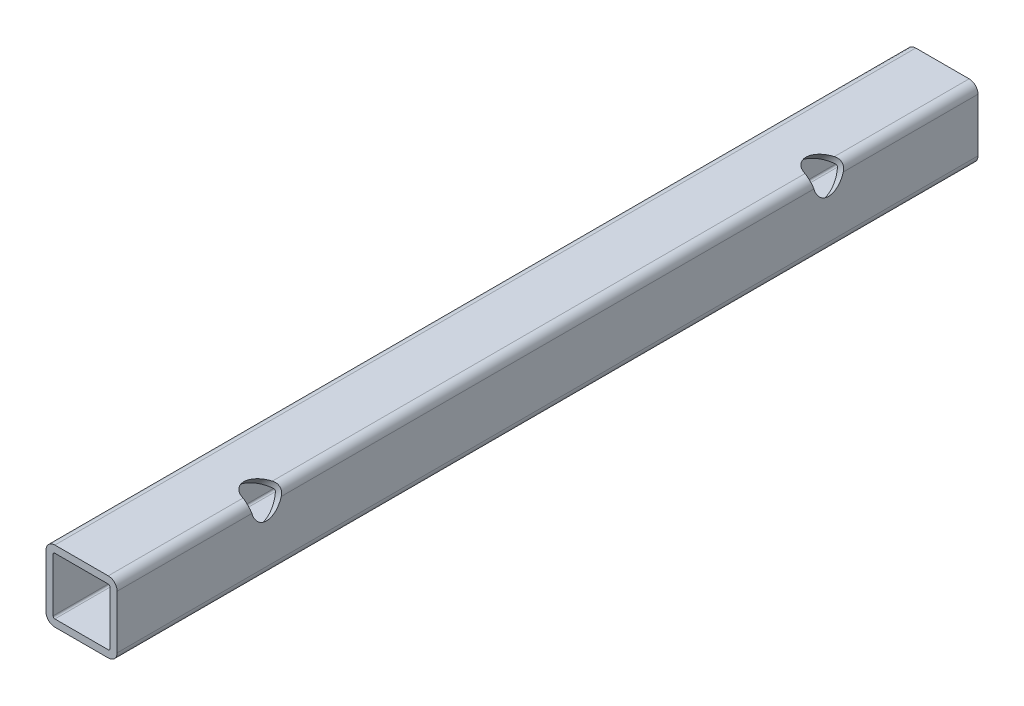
ISO-10303-21;
HEADER;
FILE_DESCRIPTION(('STEP AP214'),'2;1');
FILE_NAME('part.step','',(''),(''),'','','');
FILE_SCHEMA(('AUTOMOTIVE_DESIGN { 1 0 10303 214 1 1 1 1 }'));
ENDSEC;
DATA;
#1=APPLICATION_CONTEXT('core data for automotive mechanical design processes');
#2=APPLICATION_PROTOCOL_DEFINITION('international standard','automotive_design',2000,#1);
#3=PRODUCT_CONTEXT('',#1,'mechanical');
#4=PRODUCT('Part','Part','',(#3));
#5=PRODUCT_RELATED_PRODUCT_CATEGORY('part','',(#4));
#6=PRODUCT_DEFINITION_FORMATION('','',#4);
#7=PRODUCT_DEFINITION_CONTEXT('part definition',#1,'design');
#8=PRODUCT_DEFINITION('design','',#6,#7);
#9=PRODUCT_DEFINITION_SHAPE('','',#8);
#10=(LENGTH_UNIT() NAMED_UNIT(*) SI_UNIT(.MILLI.,.METRE.));
#11=(NAMED_UNIT(*) PLANE_ANGLE_UNIT() SI_UNIT($,.RADIAN.));
#12=(NAMED_UNIT(*) SI_UNIT($,.STERADIAN.) SOLID_ANGLE_UNIT());
#13=UNCERTAINTY_MEASURE_WITH_UNIT(LENGTH_MEASURE(1.E-05),#10,'distance_accuracy_value','');
#14=(GEOMETRIC_REPRESENTATION_CONTEXT(3) GLOBAL_UNCERTAINTY_ASSIGNED_CONTEXT((#13)) GLOBAL_UNIT_ASSIGNED_CONTEXT((#10,
#11,#12)) REPRESENTATION_CONTEXT('',''));
#15=CARTESIAN_POINT('',(0.,0.,0.));
#16=DIRECTION('',(0.,0.,1.));
#17=DIRECTION('',(1.,0.,0.));
#18=AXIS2_PLACEMENT_3D('',#15,#16,#17);
#19=CARTESIAN_POINT('',(7.5,7.5,121.));
#20=DIRECTION('',(0.,0.,-1.));
#21=DIRECTION('',(-1.,0.,0.));
#22=AXIS2_PLACEMENT_3D('',#19,#20,#21);
#23=CYLINDRICAL_SURFACE('',#22,2.5);
#24=DIRECTION('',(0.,0.,-1.));
#25=VECTOR('',#24,1.);
#26=CARTESIAN_POINT('',(10.,7.5,121.));
#27=LINE('',#26,#25);
#28=CARTESIAN_POINT('',(10.,7.5,74.8617636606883));
#29=VERTEX_POINT('',#28);
#30=CARTESIAN_POINT('',(10.,7.5,-74.8617636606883));
#31=VERTEX_POINT('',#30);
#32=EDGE_CURVE('E207',#29,#31,#27,.T.);
#33=ORIENTED_EDGE('',*,*,#32,.T.);
#34=CARTESIAN_POINT('',(7.5,10.,-74.8617636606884));
#35=CARTESIAN_POINT('',(7.56801742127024,9.99999288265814,-74.8412157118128));
#36=CARTESIAN_POINT('',(7.63605257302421,9.99722261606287,-74.8208214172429));
#37=CARTESIAN_POINT('',(7.77192206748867,9.98610525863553,-74.7807816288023));
#38=CARTESIAN_POINT('',(7.83975629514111,9.977755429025,-74.7611365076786));
#39=CARTESIAN_POINT('',(8.04304815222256,9.94417462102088,-74.7038644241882));
#40=CARTESIAN_POINT('',(8.17774096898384,9.91041140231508,-74.6680741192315));
#41=CARTESIAN_POINT('',(8.44188457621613,9.82000225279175,-74.6048703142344));
#42=CARTESIAN_POINT('',(8.57131520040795,9.76327602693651,-74.5774868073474));
#43=CARTESIAN_POINT('',(8.81994058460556,9.62783956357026,-74.5343029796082));
#44=CARTESIAN_POINT('',(8.93916097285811,9.54918661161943,-74.5184728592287));
#45=CARTESIAN_POINT('',(9.15322944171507,9.37984306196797,-74.5009833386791));
#46=CARTESIAN_POINT('',(9.24929710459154,9.29080637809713,-74.4982058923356));
#47=CARTESIAN_POINT('',(9.42618592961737,9.09900548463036,-74.5040612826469));
#48=CARTESIAN_POINT('',(9.50700658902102,8.99624082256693,-74.512694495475));
#49=CARTESIAN_POINT('',(9.64720068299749,8.78631364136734,-74.5397176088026));
#50=CARTESIAN_POINT('',(9.70750048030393,8.67969302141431,-74.557552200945));
#51=CARTESIAN_POINT('',(9.81150540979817,8.46007000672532,-74.6010903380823));
#52=CARTESIAN_POINT('',(9.85519170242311,8.34706053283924,-74.6268027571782));
#53=CARTESIAN_POINT('',(9.92706193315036,8.11241742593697,-74.6852974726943));
#54=CARTESIAN_POINT('',(9.95450938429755,7.99062132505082,-74.7183334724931));
#55=CARTESIAN_POINT('',(9.98185390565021,7.80696951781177,-74.7706121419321));
#56=CARTESIAN_POINT('',(9.98866438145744,7.74565786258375,-74.7884721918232));
#57=CARTESIAN_POINT('',(9.99773419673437,7.62289230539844,-74.824768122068));
#58=CARTESIAN_POINT('',(9.99999521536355,7.56143846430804,-74.8432037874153));
#59=CARTESIAN_POINT('',(10.,7.49999999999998,-74.8617636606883));
#60=B_SPLINE_CURVE_WITH_KNOTS('',3,(#34,#35,#36,#37,#38,#39,#40,#41,#42,#43,#44,#45,#46,#47,#48,
#49,#50,#51,#52,#53,#54,#55,#56,#57,#58,#59),.UNSPECIFIED.,.F.,.F.,(4,2,2,2,2,2,2,2,2,2,2,2,4),
(0.,0.213047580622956,0.426199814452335,0.854225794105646,1.28376156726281,1.71218548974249,
2.10314834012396,2.49412407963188,2.86386745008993,3.23402886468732,3.61989764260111,
3.81242599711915,4.00488327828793),.UNSPECIFIED.);
#61=CARTESIAN_POINT('',(7.5,10.,-74.8617636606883));
#62=VERTEX_POINT('',#61);
#63=EDGE_CURVE('E193',#62,#31,#60,.T.);
#64=ORIENTED_EDGE('',*,*,#63,.F.);
#65=DIRECTION('',(0.,0.,-1.));
#66=VECTOR('',#65,1.);
#67=CARTESIAN_POINT('',(7.5,10.,121.));
#68=LINE('',#67,#66);
#69=CARTESIAN_POINT('',(7.5,10.,74.8617636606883));
#70=VERTEX_POINT('',#69);
#71=EDGE_CURVE('E205',#70,#62,#68,.T.);
#72=ORIENTED_EDGE('',*,*,#71,.F.);
#73=CARTESIAN_POINT('',(10.,7.5,74.8617636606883));
#74=CARTESIAN_POINT('',(9.99999288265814,7.56801742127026,74.8412157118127));
#75=CARTESIAN_POINT('',(9.99722261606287,7.63605257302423,74.8208214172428));
#76=CARTESIAN_POINT('',(9.98610525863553,7.7719220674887,74.7807816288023));
#77=CARTESIAN_POINT('',(9.977755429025,7.83975629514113,74.7611365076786));
#78=CARTESIAN_POINT('',(9.94417462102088,8.04304815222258,74.7038644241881));
#79=CARTESIAN_POINT('',(9.91041140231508,8.17774096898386,74.6680741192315));
#80=CARTESIAN_POINT('',(9.82000225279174,8.44188457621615,74.6048703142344));
#81=CARTESIAN_POINT('',(9.7632760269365,8.57131520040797,74.5774868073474));
#82=CARTESIAN_POINT('',(9.62783956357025,8.81994058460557,74.5343029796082));
#83=CARTESIAN_POINT('',(9.54918661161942,8.93916097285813,74.5184728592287));
#84=CARTESIAN_POINT('',(9.37984306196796,9.15322944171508,74.5009833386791));
#85=CARTESIAN_POINT('',(9.29080637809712,9.24929710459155,74.4982058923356));
#86=CARTESIAN_POINT('',(9.09900548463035,9.42618592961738,74.5040612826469));
#87=CARTESIAN_POINT('',(8.99624082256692,9.50700658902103,74.512694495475));
#88=CARTESIAN_POINT('',(8.78631364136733,9.64720068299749,74.5397176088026));
#89=CARTESIAN_POINT('',(8.67969302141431,9.70750048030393,74.557552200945));
#90=CARTESIAN_POINT('',(8.46007000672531,9.81150540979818,74.6010903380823));
#91=CARTESIAN_POINT('',(8.34706053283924,9.85519170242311,74.6268027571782));
#92=CARTESIAN_POINT('',(8.11241742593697,9.92706193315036,74.6852974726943));
#93=CARTESIAN_POINT('',(7.99062132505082,9.95450938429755,74.7183334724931));
#94=CARTESIAN_POINT('',(7.80696951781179,9.98185390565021,74.7706121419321));
#95=CARTESIAN_POINT('',(7.74565786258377,9.98866438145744,74.7884721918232));
#96=CARTESIAN_POINT('',(7.62289230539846,9.99773419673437,74.824768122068));
#97=CARTESIAN_POINT('',(7.56143846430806,9.99999521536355,74.8432037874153));
#98=CARTESIAN_POINT('',(7.5,10.,74.8617636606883));
#99=B_SPLINE_CURVE_WITH_KNOTS('',3,(#73,#74,#75,#76,#77,#78,#79,#80,#81,#82,#83,#84,#85,#86,#87,
#88,#89,#90,#91,#92,#93,#94,#95,#96,#97,#98),.UNSPECIFIED.,.F.,.F.,(4,2,2,2,2,2,2,2,2,2,2,2,4),
(0.,0.21304758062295,0.426199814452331,0.854225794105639,1.28376156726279,1.71218548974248,
2.10314834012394,2.49412407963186,2.8638674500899,3.2340288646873,3.61989764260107,
3.8124259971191,4.00488327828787),.UNSPECIFIED.);
#100=EDGE_CURVE('E407',#29,#70,#99,.T.);
#101=ORIENTED_EDGE('',*,*,#100,.F.);
#102=EDGE_LOOP('',(#33,#64,#72,#101));
#103=FACE_BOUND('',#102,.T.);
#104=ADVANCED_FACE('F32',(#103),#23,.T.);
#105=CARTESIAN_POINT('',(7.5,7.5,121.));
#106=DIRECTION('',(0.,0.,-1.));
#107=DIRECTION('',(-1.,0.,0.));
#108=AXIS2_PLACEMENT_3D('',#105,#106,#107);
#109=CYLINDRICAL_SURFACE('',#108,0.5);
#110=CARTESIAN_POINT('',(7.5,8.,-74.5139103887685));
#111=CARTESIAN_POINT('',(7.52809632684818,8.00002306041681,-74.5123413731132));
#112=CARTESIAN_POINT('',(7.55618767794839,7.99763311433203,-74.5107793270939));
#113=CARTESIAN_POINT('',(7.61157101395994,7.98819497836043,-74.5078298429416));
#114=CARTESIAN_POINT('',(7.63886342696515,7.98114933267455,-74.5064423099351));
#115=CARTESIAN_POINT('',(7.69190775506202,7.96256165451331,-74.503999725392));
#116=CARTESIAN_POINT('',(7.71765873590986,7.95101692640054,-74.5029448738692));
#117=CARTESIAN_POINT('',(7.76686103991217,7.92376338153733,-74.5012867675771));
#118=CARTESIAN_POINT('',(7.7903129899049,7.90805570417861,-74.5006833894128));
#119=CARTESIAN_POINT('',(7.83416242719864,7.87298876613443,-74.499997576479));
#120=CARTESIAN_POINT('',(7.85457161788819,7.85364417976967,-74.499913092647));
#121=CARTESIAN_POINT('',(7.89186655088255,7.81181059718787,-74.5002690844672));
#122=CARTESIAN_POINT('',(7.90875163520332,7.78932101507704,-74.5007096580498));
#123=CARTESIAN_POINT('',(7.93847910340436,7.74190405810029,-74.5020646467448));
#124=CARTESIAN_POINT('',(7.95133107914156,7.71698265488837,-74.5029779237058));
#125=CARTESIAN_POINT('',(7.97268817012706,7.66536329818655,-74.5051760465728));
#126=CARTESIAN_POINT('',(7.98119545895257,7.63866624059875,-74.5064607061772));
#127=CARTESIAN_POINT('',(7.99159862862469,7.59318413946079,-74.5087988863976));
#128=CARTESIAN_POINT('',(7.99474740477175,7.57467243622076,-74.5097902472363));
#129=CARTESIAN_POINT('',(7.99894779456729,7.53744290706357,-74.5118241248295));
#130=CARTESIAN_POINT('',(8.00000246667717,7.51872542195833,-74.5128665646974));
#131=CARTESIAN_POINT('',(8.,7.49999999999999,-74.5139103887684));
#132=B_SPLINE_CURVE_WITH_KNOTS('',3,(#110,#111,#112,#113,#114,#115,#116,#117,#118,#119,#120,
#121,#122,#123,#124,#125,#126,#127,#128,#129,#130,#131),.UNSPECIFIED.,.F.,.F.,(4,2,2,2,2,2,2,2,
2,2,4),(0.,0.084311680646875,0.168577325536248,0.252893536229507,0.337186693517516,
0.421146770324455,0.505122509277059,0.588896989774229,0.672629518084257,0.728930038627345,
0.785148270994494),.UNSPECIFIED.);
#133=CARTESIAN_POINT('',(7.5,8.,-74.5139103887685));
#134=VERTEX_POINT('',#133);
#135=CARTESIAN_POINT('',(8.,7.5,-74.5139103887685));
#136=VERTEX_POINT('',#135);
#137=EDGE_CURVE('E55',#134,#136,#132,.T.);
#138=ORIENTED_EDGE('',*,*,#137,.T.);
#139=DIRECTION('',(0.,0.,-1.));
#140=VECTOR('',#139,1.);
#141=CARTESIAN_POINT('',(8.,7.5,121.));
#142=LINE('',#141,#140);
#143=CARTESIAN_POINT('',(8.,7.5,74.5139103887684));
#144=VERTEX_POINT('',#143);
#145=EDGE_CURVE('E320',#144,#136,#142,.T.);
#146=ORIENTED_EDGE('',*,*,#145,.F.);
#147=CARTESIAN_POINT('',(8.,7.5,74.5139103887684));
#148=CARTESIAN_POINT('',(8.00002306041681,7.52809632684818,74.5123413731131));
#149=CARTESIAN_POINT('',(7.99763311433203,7.55618767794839,74.5107793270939));
#150=CARTESIAN_POINT('',(7.98819497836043,7.61157101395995,74.5078298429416));
#151=CARTESIAN_POINT('',(7.98114933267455,7.63886342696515,74.5064423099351));
#152=CARTESIAN_POINT('',(7.9625616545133,7.69190775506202,74.503999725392));
#153=CARTESIAN_POINT('',(7.95101692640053,7.71765873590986,74.5029448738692));
#154=CARTESIAN_POINT('',(7.92376338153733,7.76686103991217,74.5012867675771));
#155=CARTESIAN_POINT('',(7.9080557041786,7.79031298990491,74.5006833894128));
#156=CARTESIAN_POINT('',(7.87298876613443,7.83416242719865,74.499997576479));
#157=CARTESIAN_POINT('',(7.85364417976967,7.8545716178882,74.499913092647));
#158=CARTESIAN_POINT('',(7.81181059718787,7.89186655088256,74.5002690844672));
#159=CARTESIAN_POINT('',(7.78932101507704,7.90875163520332,74.5007096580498));
#160=CARTESIAN_POINT('',(7.74190405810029,7.93847910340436,74.5020646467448));
#161=CARTESIAN_POINT('',(7.71698265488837,7.95133107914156,74.5029779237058));
#162=CARTESIAN_POINT('',(7.66536329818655,7.97268817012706,74.5051760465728));
#163=CARTESIAN_POINT('',(7.63866624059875,7.98119545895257,74.5064607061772));
#164=CARTESIAN_POINT('',(7.59318413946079,7.99159862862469,74.5087988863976));
#165=CARTESIAN_POINT('',(7.57467243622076,7.99474740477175,74.5097902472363));
#166=CARTESIAN_POINT('',(7.53744290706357,7.99894779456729,74.5118241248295));
#167=CARTESIAN_POINT('',(7.51872542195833,8.00000246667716,74.5128665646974));
#168=CARTESIAN_POINT('',(7.5,8.,74.5139103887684));
#169=B_SPLINE_CURVE_WITH_KNOTS('',3,(#147,#148,#149,#150,#151,#152,#153,#154,#155,#156,#157,
#158,#159,#160,#161,#162,#163,#164,#165,#166,#167,#168),.UNSPECIFIED.,.F.,.F.,(4,2,2,2,2,2,2,2,
2,2,4),(0.,0.0843116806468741,0.168577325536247,0.252893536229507,0.337186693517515,
0.421146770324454,0.505122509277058,0.588896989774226,0.672629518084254,0.728930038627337,
0.785148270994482),.UNSPECIFIED.);
#170=CARTESIAN_POINT('',(7.5,8.,74.5139103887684));
#171=VERTEX_POINT('',#170);
#172=EDGE_CURVE('E376',#144,#171,#169,.T.);
#173=ORIENTED_EDGE('',*,*,#172,.T.);
#174=DIRECTION('',(0.,0.,-1.));
#175=VECTOR('',#174,1.);
#176=CARTESIAN_POINT('',(7.5,8.,121.));
#177=LINE('',#176,#175);
#178=EDGE_CURVE('E325',#171,#134,#177,.T.);
#179=ORIENTED_EDGE('',*,*,#178,.T.);
#180=EDGE_LOOP('',(#138,#146,#173,#179));
#181=FACE_BOUND('',#180,.T.);
#182=ADVANCED_FACE('F447',(#181),#109,.F.);
#183=CARTESIAN_POINT('',(10.,7.5,121.));
#184=VERTEX_POINT('',#183);
#185=CARTESIAN_POINT('',(10.,7.5,83.1382363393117));
#186=VERTEX_POINT('',#185);
#187=EDGE_CURVE('E221',#184,#186,#27,.T.);
#188=ORIENTED_EDGE('',*,*,#187,.T.);
#189=CARTESIAN_POINT('',(7.5,10.,83.1382363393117));
#190=CARTESIAN_POINT('',(7.56801742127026,9.99999288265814,83.1587842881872));
#191=CARTESIAN_POINT('',(7.63605257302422,9.99722261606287,83.1791785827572));
#192=CARTESIAN_POINT('',(7.77192206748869,9.98610525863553,83.2192183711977));
#193=CARTESIAN_POINT('',(7.83975629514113,9.977755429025,83.2388634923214));
#194=CARTESIAN_POINT('',(8.04304815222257,9.94417462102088,83.2961355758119));
#195=CARTESIAN_POINT('',(8.17774096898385,9.91041140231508,83.3319258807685));
#196=CARTESIAN_POINT('',(8.44188457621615,9.82000225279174,83.3951296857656));
#197=CARTESIAN_POINT('',(8.57131520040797,9.7632760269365,83.4225131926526));
#198=CARTESIAN_POINT('',(8.81994058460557,9.62783956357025,83.4656970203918));
#199=CARTESIAN_POINT('',(8.93916097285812,9.54918661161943,83.4815271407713));
#200=CARTESIAN_POINT('',(9.15322944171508,9.37984306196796,83.4990166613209));
#201=CARTESIAN_POINT('',(9.24929710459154,9.29080637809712,83.5017941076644));
#202=CARTESIAN_POINT('',(9.42618592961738,9.09900548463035,83.4959387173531));
#203=CARTESIAN_POINT('',(9.50700658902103,8.99624082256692,83.487305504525));
#204=CARTESIAN_POINT('',(9.64720068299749,8.78631364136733,83.4602823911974));
#205=CARTESIAN_POINT('',(9.70750048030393,8.67969302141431,83.442447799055));
#206=CARTESIAN_POINT('',(9.81150540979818,8.46007000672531,83.3989096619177));
#207=CARTESIAN_POINT('',(9.85519170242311,8.34706053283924,83.3731972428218));
#208=CARTESIAN_POINT('',(9.92706193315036,8.11241742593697,83.3147025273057));
#209=CARTESIAN_POINT('',(9.95450938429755,7.99062132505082,83.2816665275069));
#210=CARTESIAN_POINT('',(9.98185390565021,7.80696951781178,83.2293878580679));
#211=CARTESIAN_POINT('',(9.98866438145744,7.74565786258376,83.2115278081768));
#212=CARTESIAN_POINT('',(9.99773419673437,7.62289230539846,83.175231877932));
#213=CARTESIAN_POINT('',(9.99999521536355,7.56143846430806,83.1567962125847));
#214=CARTESIAN_POINT('',(10.,7.49999999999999,83.1382363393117));
#215=B_SPLINE_CURVE_WITH_KNOTS('',3,(#189,#190,#191,#192,#193,#194,#195,#196,#197,#198,#199,
#200,#201,#202,#203,#204,#205,#206,#207,#208,#209,#210,#211,#212,#213,#214),.UNSPECIFIED.,.F.,
.F.,(4,2,2,2,2,2,2,2,2,2,2,2,4),(0.,0.213047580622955,0.426199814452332,0.854225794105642,
1.28376156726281,1.71218548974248,2.10314834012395,2.49412407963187,2.86386745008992,
3.23402886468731,3.61989764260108,3.81242599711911,4.00488327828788),.UNSPECIFIED.);
#216=CARTESIAN_POINT('',(7.5,10.,83.1382363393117));
#217=VERTEX_POINT('',#216);
#218=EDGE_CURVE('E401',#217,#186,#215,.T.);
#219=ORIENTED_EDGE('',*,*,#218,.F.);
#220=CARTESIAN_POINT('',(7.5,10.,121.));
#221=VERTEX_POINT('',#220);
#222=EDGE_CURVE('E213',#221,#217,#68,.T.);
#223=ORIENTED_EDGE('',*,*,#222,.F.);
#224=CARTESIAN_POINT('',(7.5,7.5,121.));
#225=DIRECTION('',(0.,0.,1.));
#226=DIRECTION('',(-1.,0.,0.));
#227=AXIS2_PLACEMENT_3D('',#224,#225,#226);
#228=CIRCLE('',#227,2.5);
#229=EDGE_CURVE('E297',#184,#221,#228,.T.);
#230=ORIENTED_EDGE('',*,*,#229,.F.);
#231=EDGE_LOOP('',(#188,#219,#223,#230));
#232=FACE_BOUND('',#231,.T.);
#233=ADVANCED_FACE('F460',(#232),#23,.T.);
#234=CARTESIAN_POINT('',(7.5,8.,83.4860896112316));
#235=CARTESIAN_POINT('',(7.52809632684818,8.00002306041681,83.4876586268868));
#236=CARTESIAN_POINT('',(7.55618767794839,7.99763311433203,83.4892206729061));
#237=CARTESIAN_POINT('',(7.61157101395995,7.98819497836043,83.4921701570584));
#238=CARTESIAN_POINT('',(7.63886342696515,7.98114933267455,83.4935576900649));
#239=CARTESIAN_POINT('',(7.69190775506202,7.9625616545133,83.496000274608));
#240=CARTESIAN_POINT('',(7.71765873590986,7.95101692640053,83.4970551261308));
#241=CARTESIAN_POINT('',(7.76686103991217,7.92376338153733,83.4987132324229));
#242=CARTESIAN_POINT('',(7.79031298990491,7.9080557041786,83.4993166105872));
#243=CARTESIAN_POINT('',(7.83416242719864,7.87298876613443,83.500002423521));
#244=CARTESIAN_POINT('',(7.8545716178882,7.85364417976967,83.500086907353));
#245=CARTESIAN_POINT('',(7.89186655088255,7.81181059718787,83.4997309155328));
#246=CARTESIAN_POINT('',(7.90875163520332,7.78932101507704,83.4992903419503));
#247=CARTESIAN_POINT('',(7.93847910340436,7.74190405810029,83.4979353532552));
#248=CARTESIAN_POINT('',(7.95133107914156,7.71698265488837,83.4970220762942));
#249=CARTESIAN_POINT('',(7.97268817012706,7.66536329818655,83.4948239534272));
#250=CARTESIAN_POINT('',(7.98119545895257,7.63866624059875,83.4935392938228));
#251=CARTESIAN_POINT('',(7.99159862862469,7.59318413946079,83.4912011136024));
#252=CARTESIAN_POINT('',(7.99474740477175,7.57467243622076,83.4902097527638));
#253=CARTESIAN_POINT('',(7.99894779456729,7.53744290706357,83.4881758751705));
#254=CARTESIAN_POINT('',(8.00000246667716,7.51872542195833,83.4871334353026));
#255=CARTESIAN_POINT('',(8.,7.5,83.4860896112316));
#256=B_SPLINE_CURVE_WITH_KNOTS('',3,(#234,#235,#236,#237,#238,#239,#240,#241,#242,#243,#244,
#245,#246,#247,#248,#249,#250,#251,#252,#253,#254,#255),.UNSPECIFIED.,.F.,.F.,(4,2,2,2,2,2,2,2,
2,2,4),(0.,0.0843116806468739,0.168577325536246,0.252893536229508,0.337186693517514,
0.421146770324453,0.505122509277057,0.588896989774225,0.672629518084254,0.728930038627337,
0.785148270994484),.UNSPECIFIED.);
#257=CARTESIAN_POINT('',(7.5,8.,83.4860896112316));
#258=VERTEX_POINT('',#257);
#259=CARTESIAN_POINT('',(8.,7.5,83.4860896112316));
#260=VERTEX_POINT('',#259);
#261=EDGE_CURVE('E384',#258,#260,#256,.T.);
#262=ORIENTED_EDGE('',*,*,#261,.T.);
#263=CARTESIAN_POINT('',(8.,7.5,121.));
#264=VERTEX_POINT('',#263);
#265=EDGE_CURVE('E317',#264,#260,#142,.T.);
#266=ORIENTED_EDGE('',*,*,#265,.F.);
#267=CARTESIAN_POINT('',(7.5,7.5,121.));
#268=DIRECTION('',(0.,0.,1.));
#269=DIRECTION('',(-1.,0.,0.));
#270=AXIS2_PLACEMENT_3D('',#267,#268,#269);
#271=CIRCLE('',#270,0.5);
#272=CARTESIAN_POINT('',(7.5,8.,121.));
#273=VERTEX_POINT('',#272);
#274=EDGE_CURVE('E357',#264,#273,#271,.T.);
#275=ORIENTED_EDGE('',*,*,#274,.T.);
#276=EDGE_CURVE('E322',#273,#258,#177,.T.);
#277=ORIENTED_EDGE('',*,*,#276,.T.);
#278=EDGE_LOOP('',(#262,#266,#275,#277));
#279=FACE_BOUND('',#278,.T.);
#280=ADVANCED_FACE('F418',(#279),#109,.F.);
#281=CARTESIAN_POINT('',(-7.5,-7.5,121.));
#282=DIRECTION('',(0.,0.,1.));
#283=DIRECTION('',(1.,0.,0.));
#284=AXIS2_PLACEMENT_3D('',#281,#282,#283);
#285=PLANE('',#284);
#286=CARTESIAN_POINT('',(-7.5,-7.5,121.));
#287=DIRECTION('',(0.,0.,1.));
#288=DIRECTION('',(1.,0.,0.));
#289=AXIS2_PLACEMENT_3D('',#286,#287,#288);
#290=CIRCLE('',#289,2.5);
#291=CARTESIAN_POINT('',(-10.,-7.5,121.));
#292=VERTEX_POINT('',#291);
#293=CARTESIAN_POINT('',(-7.5,-10.,121.));
#294=VERTEX_POINT('',#293);
#295=EDGE_CURVE('E260',#292,#294,#290,.T.);
#296=ORIENTED_EDGE('',*,*,#295,.T.);
#297=DIRECTION('',(1.,0.,0.));
#298=VECTOR('',#297,1.);
#299=CARTESIAN_POINT('',(-7.5,-10.,121.));
#300=LINE('',#299,#298);
#301=CARTESIAN_POINT('',(7.5,-10.,121.));
#302=VERTEX_POINT('',#301);
#303=EDGE_CURVE('E287',#294,#302,#300,.T.);
#304=ORIENTED_EDGE('',*,*,#303,.T.);
#305=CARTESIAN_POINT('',(7.5,-7.5,121.));
#306=DIRECTION('',(0.,0.,1.));
#307=DIRECTION('',(1.,0.,0.));
#308=AXIS2_PLACEMENT_3D('',#305,#306,#307);
#309=CIRCLE('',#308,2.5);
#310=CARTESIAN_POINT('',(10.,-7.5,121.));
#311=VERTEX_POINT('',#310);
#312=EDGE_CURVE('E234',#302,#311,#309,.T.);
#313=ORIENTED_EDGE('',*,*,#312,.T.);
#314=DIRECTION('',(0.,1.,0.));
#315=VECTOR('',#314,1.);
#316=CARTESIAN_POINT('',(10.,7.5,121.));
#317=LINE('',#316,#315);
#318=EDGE_CURVE('E295',#311,#184,#317,.T.);
#319=ORIENTED_EDGE('',*,*,#318,.T.);
#320=ORIENTED_EDGE('',*,*,#229,.T.);
#321=DIRECTION('',(-1.,0.,0.));
#322=VECTOR('',#321,1.);
#323=CARTESIAN_POINT('',(-7.5,10.,121.));
#324=LINE('',#323,#322);
#325=CARTESIAN_POINT('',(-7.5,10.,121.));
#326=VERTEX_POINT('',#325);
#327=EDGE_CURVE('E299',#221,#326,#324,.T.);
#328=ORIENTED_EDGE('',*,*,#327,.T.);
#329=CARTESIAN_POINT('',(-7.5,7.5,121.));
#330=DIRECTION('',(0.,0.,1.));
#331=DIRECTION('',(1.,0.,0.));
#332=AXIS2_PLACEMENT_3D('',#329,#330,#331);
#333=CIRCLE('',#332,2.5);
#334=CARTESIAN_POINT('',(-10.,7.5,121.));
#335=VERTEX_POINT('',#334);
#336=EDGE_CURVE('E276',#326,#335,#333,.T.);
#337=ORIENTED_EDGE('',*,*,#336,.T.);
#338=DIRECTION('',(0.,-1.,0.));
#339=VECTOR('',#338,1.);
#340=CARTESIAN_POINT('',(-10.,7.5,121.));
#341=LINE('',#340,#339);
#342=EDGE_CURVE('E264',#335,#292,#341,.T.);
#343=ORIENTED_EDGE('',*,*,#342,.T.);
#344=EDGE_LOOP('',(#296,#304,#313,#319,#320,#328,#337,#343));
#345=FACE_BOUND('',#344,.T.);
#346=DIRECTION('',(0.,-1.,0.));
#347=VECTOR('',#346,1.);
#348=CARTESIAN_POINT('',(-8.,7.5,121.));
#349=LINE('',#348,#347);
#350=CARTESIAN_POINT('',(-8.,7.5,121.));
#351=VERTEX_POINT('',#350);
#352=CARTESIAN_POINT('',(-8.,-7.5,121.));
#353=VERTEX_POINT('',#352);
#354=EDGE_CURVE('E368',#351,#353,#349,.T.);
#355=ORIENTED_EDGE('',*,*,#354,.F.);
#356=CARTESIAN_POINT('',(-7.5,7.5,121.));
#357=DIRECTION('',(0.,0.,1.));
#358=DIRECTION('',(1.,0.,0.));
#359=AXIS2_PLACEMENT_3D('',#356,#357,#358);
#360=CIRCLE('',#359,0.5);
#361=CARTESIAN_POINT('',(-7.5,8.,121.));
#362=VERTEX_POINT('',#361);
#363=EDGE_CURVE('E334',#362,#351,#360,.T.);
#364=ORIENTED_EDGE('',*,*,#363,.F.);
#365=DIRECTION('',(-1.,0.,0.));
#366=VECTOR('',#365,1.);
#367=CARTESIAN_POINT('',(-7.5,8.,121.));
#368=LINE('',#367,#366);
#369=EDGE_CURVE('E330',#273,#362,#368,.T.);
#370=ORIENTED_EDGE('',*,*,#369,.F.);
#371=ORIENTED_EDGE('',*,*,#274,.F.);
#372=DIRECTION('',(0.,1.,0.));
#373=VECTOR('',#372,1.);
#374=CARTESIAN_POINT('',(8.,7.5,121.));
#375=LINE('',#374,#373);
#376=CARTESIAN_POINT('',(8.,-7.5,121.));
#377=VERTEX_POINT('',#376);
#378=EDGE_CURVE('E360',#377,#264,#375,.T.);
#379=ORIENTED_EDGE('',*,*,#378,.F.);
#380=CARTESIAN_POINT('',(7.5,-7.5,121.));
#381=DIRECTION('',(0.,0.,1.));
#382=DIRECTION('',(1.,0.,0.));
#383=AXIS2_PLACEMENT_3D('',#380,#381,#382);
#384=CIRCLE('',#383,0.500000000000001);
#385=CARTESIAN_POINT('',(7.5,-8.,121.));
#386=VERTEX_POINT('',#385);
#387=EDGE_CURVE('E362',#386,#377,#384,.T.);
#388=ORIENTED_EDGE('',*,*,#387,.F.);
#389=DIRECTION('',(1.,0.,0.));
#390=VECTOR('',#389,1.);
#391=CARTESIAN_POINT('',(-7.5,-8.,121.));
#392=LINE('',#391,#390);
#393=CARTESIAN_POINT('',(-7.5,-8.,121.));
#394=VERTEX_POINT('',#393);
#395=EDGE_CURVE('E364',#394,#386,#392,.T.);
#396=ORIENTED_EDGE('',*,*,#395,.F.);
#397=CARTESIAN_POINT('',(-7.5,-7.5,121.));
#398=DIRECTION('',(0.,0.,1.));
#399=DIRECTION('',(1.,0.,0.));
#400=AXIS2_PLACEMENT_3D('',#397,#398,#399);
#401=CIRCLE('',#400,0.5);
#402=EDGE_CURVE('E366',#353,#394,#401,.T.);
#403=ORIENTED_EDGE('',*,*,#402,.F.);
#404=EDGE_LOOP('',(#355,#364,#370,#371,#379,#388,#396,#403));
#405=FACE_BOUND('',#404,.T.);
#406=ADVANCED_FACE('F432',(#345,#405),#285,.T.);
#407=CARTESIAN_POINT('',(-7.5,-7.5,-121.));
#408=DIRECTION('',(0.,0.,1.));
#409=DIRECTION('',(1.,0.,0.));
#410=AXIS2_PLACEMENT_3D('',#407,#408,#409);
#411=PLANE('',#410);
#412=CARTESIAN_POINT('',(-7.5,-7.5,-121.));
#413=DIRECTION('',(0.,0.,1.));
#414=DIRECTION('',(1.,0.,0.));
#415=AXIS2_PLACEMENT_3D('',#412,#413,#414);
#416=CIRCLE('',#415,2.5);
#417=CARTESIAN_POINT('',(-10.,-7.5,-121.));
#418=VERTEX_POINT('',#417);
#419=CARTESIAN_POINT('',(-7.5,-10.,-121.));
#420=VERTEX_POINT('',#419);
#421=EDGE_CURVE('E248',#418,#420,#416,.T.);
#422=ORIENTED_EDGE('',*,*,#421,.F.);
#423=DIRECTION('',(0.,-1.,0.));
#424=VECTOR('',#423,1.);
#425=CARTESIAN_POINT('',(-10.,7.5,-121.));
#426=LINE('',#425,#424);
#427=CARTESIAN_POINT('',(-10.,7.5,-121.));
#428=VERTEX_POINT('',#427);
#429=EDGE_CURVE('E258',#428,#418,#426,.T.);
#430=ORIENTED_EDGE('',*,*,#429,.F.);
#431=CARTESIAN_POINT('',(-7.5,7.5,-121.));
#432=DIRECTION('',(0.,0.,1.));
#433=DIRECTION('',(1.,0.,0.));
#434=AXIS2_PLACEMENT_3D('',#431,#432,#433);
#435=CIRCLE('',#434,2.5);
#436=CARTESIAN_POINT('',(-7.5,10.,-121.));
#437=VERTEX_POINT('',#436);
#438=EDGE_CURVE('E256',#437,#428,#435,.T.);
#439=ORIENTED_EDGE('',*,*,#438,.F.);
#440=DIRECTION('',(-1.,0.,0.));
#441=VECTOR('',#440,1.);
#442=CARTESIAN_POINT('',(-7.5,10.,-121.));
#443=LINE('',#442,#441);
#444=CARTESIAN_POINT('',(7.5,10.,-121.));
#445=VERTEX_POINT('',#444);
#446=EDGE_CURVE('E254',#445,#437,#443,.T.);
#447=ORIENTED_EDGE('',*,*,#446,.F.);
#448=CARTESIAN_POINT('',(7.5,7.5,-121.));
#449=DIRECTION('',(0.,0.,1.));
#450=DIRECTION('',(-1.,0.,0.));
#451=AXIS2_PLACEMENT_3D('',#448,#449,#450);
#452=CIRCLE('',#451,2.5);
#453=CARTESIAN_POINT('',(10.,7.5,-121.));
#454=VERTEX_POINT('',#453);
#455=EDGE_CURVE('E246',#454,#445,#452,.T.);
#456=ORIENTED_EDGE('',*,*,#455,.F.);
#457=DIRECTION('',(0.,1.,0.));
#458=VECTOR('',#457,1.);
#459=CARTESIAN_POINT('',(10.,7.5,-121.));
#460=LINE('',#459,#458);
#461=CARTESIAN_POINT('',(10.,-7.5,-121.));
#462=VERTEX_POINT('',#461);
#463=EDGE_CURVE('E244',#462,#454,#460,.T.);
#464=ORIENTED_EDGE('',*,*,#463,.F.);
#465=CARTESIAN_POINT('',(7.5,-7.5,-121.));
#466=DIRECTION('',(0.,0.,1.));
#467=DIRECTION('',(1.,0.,0.));
#468=AXIS2_PLACEMENT_3D('',#465,#466,#467);
#469=CIRCLE('',#468,2.5);
#470=CARTESIAN_POINT('',(7.5,-10.,-121.));
#471=VERTEX_POINT('',#470);
#472=EDGE_CURVE('E233',#471,#462,#469,.T.);
#473=ORIENTED_EDGE('',*,*,#472,.F.);
#474=DIRECTION('',(1.,0.,0.));
#475=VECTOR('',#474,1.);
#476=CARTESIAN_POINT('',(-7.5,-10.,-121.));
#477=LINE('',#476,#475);
#478=EDGE_CURVE('E241',#420,#471,#477,.T.);
#479=ORIENTED_EDGE('',*,*,#478,.F.);
#480=EDGE_LOOP('',(#422,#430,#439,#447,#456,#464,#473,#479));
#481=FACE_BOUND('',#480,.T.);
#482=CARTESIAN_POINT('',(-7.5,7.5,-121.));
#483=DIRECTION('',(0.,0.,1.));
#484=DIRECTION('',(1.,0.,0.));
#485=AXIS2_PLACEMENT_3D('',#482,#483,#484);
#486=CIRCLE('',#485,0.5);
#487=CARTESIAN_POINT('',(-7.5,8.,-121.));
#488=VERTEX_POINT('',#487);
#489=CARTESIAN_POINT('',(-8.,7.5,-121.));
#490=VERTEX_POINT('',#489);
#491=EDGE_CURVE('E353',#488,#490,#486,.T.);
#492=ORIENTED_EDGE('',*,*,#491,.T.);
#493=DIRECTION('',(0.,-1.,0.));
#494=VECTOR('',#493,1.);
#495=CARTESIAN_POINT('',(-8.,7.5,-121.));
#496=LINE('',#495,#494);
#497=CARTESIAN_POINT('',(-8.,-7.5,-121.));
#498=VERTEX_POINT('',#497);
#499=EDGE_CURVE('E350',#490,#498,#496,.T.);
#500=ORIENTED_EDGE('',*,*,#499,.T.);
#501=CARTESIAN_POINT('',(-7.5,-7.5,-121.));
#502=DIRECTION('',(0.,0.,1.));
#503=DIRECTION('',(1.,0.,0.));
#504=AXIS2_PLACEMENT_3D('',#501,#502,#503);
#505=CIRCLE('',#504,0.5);
#506=CARTESIAN_POINT('',(-7.5,-8.,-121.));
#507=VERTEX_POINT('',#506);
#508=EDGE_CURVE('E347',#498,#507,#505,.T.);
#509=ORIENTED_EDGE('',*,*,#508,.T.);
#510=DIRECTION('',(1.,0.,0.));
#511=VECTOR('',#510,1.);
#512=CARTESIAN_POINT('',(-7.5,-8.,-121.));
#513=LINE('',#512,#511);
#514=CARTESIAN_POINT('',(7.5,-8.,-121.));
#515=VERTEX_POINT('',#514);
#516=EDGE_CURVE('E344',#507,#515,#513,.T.);
#517=ORIENTED_EDGE('',*,*,#516,.T.);
#518=CARTESIAN_POINT('',(7.5,-7.5,-121.));
#519=DIRECTION('',(0.,0.,1.));
#520=DIRECTION('',(1.,0.,0.));
#521=AXIS2_PLACEMENT_3D('',#518,#519,#520);
#522=CIRCLE('',#521,0.500000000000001);
#523=CARTESIAN_POINT('',(8.,-7.5,-121.));
#524=VERTEX_POINT('',#523);
#525=EDGE_CURVE('E341',#515,#524,#522,.T.);
#526=ORIENTED_EDGE('',*,*,#525,.T.);
#527=DIRECTION('',(0.,1.,0.));
#528=VECTOR('',#527,1.);
#529=CARTESIAN_POINT('',(8.,7.5,-121.));
#530=LINE('',#529,#528);
#531=CARTESIAN_POINT('',(8.,7.5,-121.));
#532=VERTEX_POINT('',#531);
#533=EDGE_CURVE('E338',#524,#532,#530,.T.);
#534=ORIENTED_EDGE('',*,*,#533,.T.);
#535=CARTESIAN_POINT('',(7.5,7.5,-121.));
#536=DIRECTION('',(0.,0.,1.));
#537=DIRECTION('',(-1.,0.,0.));
#538=AXIS2_PLACEMENT_3D('',#535,#536,#537);
#539=CIRCLE('',#538,0.5);
#540=CARTESIAN_POINT('',(7.5,8.,-121.));
#541=VERTEX_POINT('',#540);
#542=EDGE_CURVE('E335',#532,#541,#539,.T.);
#543=ORIENTED_EDGE('',*,*,#542,.T.);
#544=DIRECTION('',(-1.,0.,0.));
#545=VECTOR('',#544,1.);
#546=CARTESIAN_POINT('',(-7.5,8.,-121.));
#547=LINE('',#546,#545);
#548=EDGE_CURVE('E331',#541,#488,#547,.T.);
#549=ORIENTED_EDGE('',*,*,#548,.T.);
#550=EDGE_LOOP('',(#492,#500,#509,#517,#526,#534,#543,#549));
#551=FACE_BOUND('',#550,.T.);
#552=ADVANCED_FACE('F239',(#481,#551),#411,.F.);
#553=CARTESIAN_POINT('',(-7.5,-7.5,121.));
#554=DIRECTION('',(0.,0.,-1.));
#555=DIRECTION('',(-1.,0.,0.));
#556=AXIS2_PLACEMENT_3D('',#553,#554,#555);
#557=CYLINDRICAL_SURFACE('',#556,2.5);
#558=ORIENTED_EDGE('',*,*,#421,.T.);
#559=DIRECTION('',(0.,0.,-1.));
#560=VECTOR('',#559,1.);
#561=CARTESIAN_POINT('',(-7.5,-10.,121.));
#562=LINE('',#561,#560);
#563=EDGE_CURVE('E11',#294,#420,#562,.T.);
#564=ORIENTED_EDGE('',*,*,#563,.F.);
#565=ORIENTED_EDGE('',*,*,#295,.F.);
#566=DIRECTION('',(0.,0.,-1.));
#567=VECTOR('',#566,1.);
#568=CARTESIAN_POINT('',(-10.,-7.5,121.));
#569=LINE('',#568,#567);
#570=EDGE_CURVE('E261',#292,#418,#569,.T.);
#571=ORIENTED_EDGE('',*,*,#570,.T.);
#572=EDGE_LOOP('',(#558,#564,#565,#571));
#573=FACE_BOUND('',#572,.T.);
#574=ADVANCED_FACE('F34',(#573),#557,.T.);
#575=CARTESIAN_POINT('',(-7.5,-10.,121.));
#576=DIRECTION('',(0.,1.,0.));
#577=DIRECTION('',(0.,0.,1.));
#578=AXIS2_PLACEMENT_3D('',#575,#576,#577);
#579=PLANE('',#578);
#580=ORIENTED_EDGE('',*,*,#478,.T.);
#581=DIRECTION('',(0.,0.,-1.));
#582=VECTOR('',#581,1.);
#583=CARTESIAN_POINT('',(7.5,-10.,121.));
#584=LINE('',#583,#582);
#585=EDGE_CURVE('E40',#302,#471,#584,.T.);
#586=ORIENTED_EDGE('',*,*,#585,.F.);
#587=ORIENTED_EDGE('',*,*,#303,.F.);
#588=ORIENTED_EDGE('',*,*,#563,.T.);
#589=EDGE_LOOP('',(#580,#586,#587,#588));
#590=FACE_BOUND('',#589,.T.);
#591=ADVANCED_FACE('F525',(#590),#579,.F.);
#592=CARTESIAN_POINT('',(7.5,-7.5,121.));
#593=DIRECTION('',(0.,0.,-1.));
#594=DIRECTION('',(-1.,0.,0.));
#595=AXIS2_PLACEMENT_3D('',#592,#593,#594);
#596=CYLINDRICAL_SURFACE('',#595,2.5);
#597=ORIENTED_EDGE('',*,*,#472,.T.);
#598=DIRECTION('',(0.,0.,-1.));
#599=VECTOR('',#598,1.);
#600=CARTESIAN_POINT('',(10.,-7.5,121.));
#601=LINE('',#600,#599);
#602=EDGE_CURVE('E224',#311,#462,#601,.T.);
#603=ORIENTED_EDGE('',*,*,#602,.F.);
#604=ORIENTED_EDGE('',*,*,#312,.F.);
#605=ORIENTED_EDGE('',*,*,#585,.T.);
#606=EDGE_LOOP('',(#597,#603,#604,#605));
#607=FACE_BOUND('',#606,.T.);
#608=ADVANCED_FACE('F231',(#607),#596,.T.);
#609=CARTESIAN_POINT('',(10.,7.5,121.));
#610=DIRECTION('',(-1.,0.,0.));
#611=DIRECTION('',(0.,-1.,0.));
#612=AXIS2_PLACEMENT_3D('',#609,#610,#611);
#613=PLANE('',#612);
#614=CARTESIAN_POINT('',(10.,7.5,-83.1382363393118));
#615=VERTEX_POINT('',#614);
#616=EDGE_CURVE('E216',#615,#454,#27,.T.);
#617=ORIENTED_EDGE('',*,*,#616,.F.);
#618=CARTESIAN_POINT('',(10.,9.99999999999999,-79.));
#619=DIRECTION('',(-1.,0.,0.));
#620=DIRECTION('',(0.,1.,0.));
#621=AXIS2_PLACEMENT_3D('',#618,#619,#620);
#622=ELLIPSE('',#621,6.36396103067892,4.5);
#623=EDGE_CURVE('E198',#31,#615,#622,.F.);
#624=ORIENTED_EDGE('',*,*,#623,.F.);
#625=ORIENTED_EDGE('',*,*,#32,.F.);
#626=CARTESIAN_POINT('',(10.,9.99999999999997,79.));
#627=DIRECTION('',(-1.,0.,0.));
#628=DIRECTION('',(0.,1.,0.));
#629=AXIS2_PLACEMENT_3D('',#626,#627,#628);
#630=ELLIPSE('',#629,6.36396103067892,4.5);
#631=EDGE_CURVE('E355',#186,#29,#630,.F.);
#632=ORIENTED_EDGE('',*,*,#631,.F.);
#633=ORIENTED_EDGE('',*,*,#187,.F.);
#634=ORIENTED_EDGE('',*,*,#318,.F.);
#635=ORIENTED_EDGE('',*,*,#602,.T.);
#636=ORIENTED_EDGE('',*,*,#463,.T.);
#637=EDGE_LOOP('',(#617,#624,#625,#632,#633,#634,#635,#636));
#638=FACE_BOUND('',#637,.T.);
#639=ADVANCED_FACE('F457',(#638),#613,.F.);
#640=CARTESIAN_POINT('',(7.5,10.,-83.1382363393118));
#641=VERTEX_POINT('',#640);
#642=EDGE_CURVE('E214',#641,#445,#68,.T.);
#643=ORIENTED_EDGE('',*,*,#642,.F.);
#644=CARTESIAN_POINT('',(10.,7.5,-83.1382363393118));
#645=CARTESIAN_POINT('',(9.99999288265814,7.56801742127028,-83.1587842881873));
#646=CARTESIAN_POINT('',(9.99722261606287,7.63605257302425,-83.1791785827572));
#647=CARTESIAN_POINT('',(9.98610525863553,7.77192206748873,-83.2192183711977));
#648=CARTESIAN_POINT('',(9.977755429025,7.83975629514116,-83.2388634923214));
#649=CARTESIAN_POINT('',(9.94417462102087,8.0430481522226,-83.2961355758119));
#650=CARTESIAN_POINT('',(9.91041140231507,8.17774096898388,-83.3319258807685));
#651=CARTESIAN_POINT('',(9.82000225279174,8.44188457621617,-83.3951296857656));
#652=CARTESIAN_POINT('',(9.7632760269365,8.57131520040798,-83.4225131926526));
#653=CARTESIAN_POINT('',(9.62783956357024,8.81994058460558,-83.4656970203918));
#654=CARTESIAN_POINT('',(9.54918661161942,8.93916097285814,-83.4815271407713));
#655=CARTESIAN_POINT('',(9.37984306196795,9.15322944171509,-83.4990166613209));
#656=CARTESIAN_POINT('',(9.29080637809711,9.24929710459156,-83.5017941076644));
#657=CARTESIAN_POINT('',(9.09900548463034,9.42618592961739,-83.4959387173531));
#658=CARTESIAN_POINT('',(8.99624082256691,9.50700658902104,-83.487305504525));
#659=CARTESIAN_POINT('',(8.78631364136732,9.6472006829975,-83.4602823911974));
#660=CARTESIAN_POINT('',(8.67969302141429,9.70750048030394,-83.442447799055));
#661=CARTESIAN_POINT('',(8.4600700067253,9.81150540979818,-83.3989096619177));
#662=CARTESIAN_POINT('',(8.34706053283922,9.85519170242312,-83.3731972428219));
#663=CARTESIAN_POINT('',(8.11241742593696,9.92706193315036,-83.3147025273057));
#664=CARTESIAN_POINT('',(7.99062132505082,9.95450938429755,-83.2816665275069));
#665=CARTESIAN_POINT('',(7.8069695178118,9.9818539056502,-83.2293878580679));
#666=CARTESIAN_POINT('',(7.74565786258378,9.98866438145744,-83.2115278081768));
#667=CARTESIAN_POINT('',(7.62289230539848,9.99773419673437,-83.175231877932));
#668=CARTESIAN_POINT('',(7.56143846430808,9.99999521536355,-83.1567962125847));
#669=CARTESIAN_POINT('',(7.50000000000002,10.,-83.1382363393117));
#670=B_SPLINE_CURVE_WITH_KNOTS('',3,(#644,#645,#646,#647,#648,#649,#650,#651,#652,#653,#654,
#655,#656,#657,#658,#659,#660,#661,#662,#663,#664,#665,#666,#667,#668,#669),.UNSPECIFIED.,.F.,
.F.,(4,2,2,2,2,2,2,2,2,2,2,2,4),(0.,0.213047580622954,0.426199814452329,0.854225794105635,
1.28376156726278,1.71218548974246,2.10314834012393,2.49412407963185,2.8638674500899,
3.23402886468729,3.61989764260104,3.81242599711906,4.00488327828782),.UNSPECIFIED.);
#671=EDGE_CURVE('E47',#615,#641,#670,.T.);
#672=ORIENTED_EDGE('',*,*,#671,.F.);
#673=ORIENTED_EDGE('',*,*,#616,.T.);
#674=ORIENTED_EDGE('',*,*,#455,.T.);
#675=EDGE_LOOP('',(#643,#672,#673,#674));
#676=FACE_BOUND('',#675,.T.);
#677=ADVANCED_FACE('F462',(#676),#23,.T.);
#678=CARTESIAN_POINT('',(-7.5,10.,121.));
#679=DIRECTION('',(0.,-1.,0.));
#680=DIRECTION('',(0.,0.,-1.));
#681=AXIS2_PLACEMENT_3D('',#678,#679,#680);
#682=PLANE('',#681);
#683=ORIENTED_EDGE('',*,*,#71,.T.);
#684=CARTESIAN_POINT('',(10.,10.,-79.));
#685=DIRECTION('',(0.,-1.,0.));
#686=DIRECTION('',(1.,0.,0.));
#687=AXIS2_PLACEMENT_3D('',#684,#685,#686);
#688=ELLIPSE('',#687,6.36396103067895,4.5);
#689=EDGE_CURVE('E190',#641,#62,#688,.F.);
#690=ORIENTED_EDGE('',*,*,#689,.F.);
#691=ORIENTED_EDGE('',*,*,#642,.T.);
#692=ORIENTED_EDGE('',*,*,#446,.T.);
#693=DIRECTION('',(0.,0.,-1.));
#694=VECTOR('',#693,1.);
#695=CARTESIAN_POINT('',(-7.5,10.,121.));
#696=LINE('',#695,#694);
#697=EDGE_CURVE('E217',#326,#437,#696,.T.);
#698=ORIENTED_EDGE('',*,*,#697,.F.);
#699=ORIENTED_EDGE('',*,*,#327,.F.);
#700=ORIENTED_EDGE('',*,*,#222,.T.);
#701=CARTESIAN_POINT('',(10.,10.,79.));
#702=DIRECTION('',(0.,-1.,0.));
#703=DIRECTION('',(1.,0.,0.));
#704=AXIS2_PLACEMENT_3D('',#701,#702,#703);
#705=ELLIPSE('',#704,6.36396103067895,4.5);
#706=EDGE_CURVE('E212',#70,#217,#705,.F.);
#707=ORIENTED_EDGE('',*,*,#706,.F.);
#708=EDGE_LOOP('',(#683,#690,#691,#692,#698,#699,#700,#707));
#709=FACE_BOUND('',#708,.T.);
#710=ADVANCED_FACE('F210',(#709),#682,.F.);
#711=CARTESIAN_POINT('',(-7.5,7.5,121.));
#712=DIRECTION('',(0.,0.,-1.));
#713=DIRECTION('',(-1.,0.,0.));
#714=AXIS2_PLACEMENT_3D('',#711,#712,#713);
#715=CYLINDRICAL_SURFACE('',#714,2.5);
#716=ORIENTED_EDGE('',*,*,#438,.T.);
#717=DIRECTION('',(0.,0.,-1.));
#718=VECTOR('',#717,1.);
#719=CARTESIAN_POINT('',(-10.,7.5,121.));
#720=LINE('',#719,#718);
#721=EDGE_CURVE('E263',#335,#428,#720,.T.);
#722=ORIENTED_EDGE('',*,*,#721,.F.);
#723=ORIENTED_EDGE('',*,*,#336,.F.);
#724=ORIENTED_EDGE('',*,*,#697,.T.);
#725=EDGE_LOOP('',(#716,#722,#723,#724));
#726=FACE_BOUND('',#725,.T.);
#727=ADVANCED_FACE('F275',(#726),#715,.T.);
#728=CARTESIAN_POINT('',(-10.,7.5,121.));
#729=DIRECTION('',(1.,0.,0.));
#730=DIRECTION('',(0.,0.,-1.));
#731=AXIS2_PLACEMENT_3D('',#728,#729,#730);
#732=PLANE('',#731);
#733=ORIENTED_EDGE('',*,*,#429,.T.);
#734=ORIENTED_EDGE('',*,*,#570,.F.);
#735=ORIENTED_EDGE('',*,*,#342,.F.);
#736=ORIENTED_EDGE('',*,*,#721,.T.);
#737=EDGE_LOOP('',(#733,#734,#735,#736));
#738=FACE_BOUND('',#737,.T.);
#739=ADVANCED_FACE('F281',(#738),#732,.F.);
#740=CARTESIAN_POINT('',(-7.5,7.5,121.));
#741=DIRECTION('',(0.,0.,-1.));
#742=DIRECTION('',(-1.,0.,0.));
#743=AXIS2_PLACEMENT_3D('',#740,#741,#742);
#744=CYLINDRICAL_SURFACE('',#743,0.5);
#745=ORIENTED_EDGE('',*,*,#491,.F.);
#746=DIRECTION('',(0.,0.,-1.));
#747=VECTOR('',#746,1.);
#748=CARTESIAN_POINT('',(-7.5,8.,121.));
#749=LINE('',#748,#747);
#750=EDGE_CURVE('E327',#362,#488,#749,.T.);
#751=ORIENTED_EDGE('',*,*,#750,.F.);
#752=ORIENTED_EDGE('',*,*,#363,.T.);
#753=DIRECTION('',(0.,0.,-1.));
#754=VECTOR('',#753,1.);
#755=CARTESIAN_POINT('',(-8.,7.5,121.));
#756=LINE('',#755,#754);
#757=EDGE_CURVE('E291',#351,#490,#756,.T.);
#758=ORIENTED_EDGE('',*,*,#757,.T.);
#759=EDGE_LOOP('',(#745,#751,#752,#758));
#760=FACE_BOUND('',#759,.T.);
#761=ADVANCED_FACE('F439',(#760),#744,.F.);
#762=CARTESIAN_POINT('',(-8.,7.5,121.));
#763=DIRECTION('',(1.,0.,0.));
#764=DIRECTION('',(0.,1.,0.));
#765=AXIS2_PLACEMENT_3D('',#762,#763,#764);
#766=PLANE('',#765);
#767=ORIENTED_EDGE('',*,*,#499,.F.);
#768=ORIENTED_EDGE('',*,*,#757,.F.);
#769=ORIENTED_EDGE('',*,*,#354,.T.);
#770=DIRECTION('',(0.,0.,-1.));
#771=VECTOR('',#770,1.);
#772=CARTESIAN_POINT('',(-8.,-7.5,121.));
#773=LINE('',#772,#771);
#774=EDGE_CURVE('E303',#353,#498,#773,.T.);
#775=ORIENTED_EDGE('',*,*,#774,.T.);
#776=EDGE_LOOP('',(#767,#768,#769,#775));
#777=FACE_BOUND('',#776,.T.);
#778=ADVANCED_FACE('F500',(#777),#766,.T.);
#779=CARTESIAN_POINT('',(-7.5,-7.5,121.));
#780=DIRECTION('',(0.,0.,-1.));
#781=DIRECTION('',(-1.,0.,0.));
#782=AXIS2_PLACEMENT_3D('',#779,#780,#781);
#783=CYLINDRICAL_SURFACE('',#782,0.5);
#784=ORIENTED_EDGE('',*,*,#508,.F.);
#785=ORIENTED_EDGE('',*,*,#774,.F.);
#786=ORIENTED_EDGE('',*,*,#402,.T.);
#787=DIRECTION('',(0.,0.,-1.));
#788=VECTOR('',#787,1.);
#789=CARTESIAN_POINT('',(-7.5,-8.,121.));
#790=LINE('',#789,#788);
#791=EDGE_CURVE('E307',#394,#507,#790,.T.);
#792=ORIENTED_EDGE('',*,*,#791,.T.);
#793=EDGE_LOOP('',(#784,#785,#786,#792));
#794=FACE_BOUND('',#793,.T.);
#795=ADVANCED_FACE('F498',(#794),#783,.F.);
#796=CARTESIAN_POINT('',(-7.5,-8.,121.));
#797=DIRECTION('',(0.,1.,0.));
#798=DIRECTION('',(0.,0.,1.));
#799=AXIS2_PLACEMENT_3D('',#796,#797,#798);
#800=PLANE('',#799);
#801=ORIENTED_EDGE('',*,*,#516,.F.);
#802=ORIENTED_EDGE('',*,*,#791,.F.);
#803=ORIENTED_EDGE('',*,*,#395,.T.);
#804=DIRECTION('',(0.,0.,-1.));
#805=VECTOR('',#804,1.);
#806=CARTESIAN_POINT('',(7.5,-8.,121.));
#807=LINE('',#806,#805);
#808=EDGE_CURVE('E311',#386,#515,#807,.T.);
#809=ORIENTED_EDGE('',*,*,#808,.T.);
#810=EDGE_LOOP('',(#801,#802,#803,#809));
#811=FACE_BOUND('',#810,.T.);
#812=ADVANCED_FACE('F494',(#811),#800,.T.);
#813=CARTESIAN_POINT('',(7.5,-7.5,121.));
#814=DIRECTION('',(0.,0.,-1.));
#815=DIRECTION('',(-1.,0.,0.));
#816=AXIS2_PLACEMENT_3D('',#813,#814,#815);
#817=CYLINDRICAL_SURFACE('',#816,0.500000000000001);
#818=ORIENTED_EDGE('',*,*,#525,.F.);
#819=ORIENTED_EDGE('',*,*,#808,.F.);
#820=ORIENTED_EDGE('',*,*,#387,.T.);
#821=DIRECTION('',(0.,0.,-1.));
#822=VECTOR('',#821,1.);
#823=CARTESIAN_POINT('',(8.,-7.5,121.));
#824=LINE('',#823,#822);
#825=EDGE_CURVE('E315',#377,#524,#824,.T.);
#826=ORIENTED_EDGE('',*,*,#825,.T.);
#827=EDGE_LOOP('',(#818,#819,#820,#826));
#828=FACE_BOUND('',#827,.T.);
#829=ADVANCED_FACE('F492',(#828),#817,.F.);
#830=CARTESIAN_POINT('',(8.,7.5,121.));
#831=DIRECTION('',(-1.,0.,0.));
#832=DIRECTION('',(0.,-1.,0.));
#833=AXIS2_PLACEMENT_3D('',#830,#831,#832);
#834=PLANE('',#833);
#835=CARTESIAN_POINT('',(8.,8.,-79.));
#836=DIRECTION('',(-1.,0.,0.));
#837=DIRECTION('',(0.,1.,0.));
#838=AXIS2_PLACEMENT_3D('',#835,#836,#837);
#839=ELLIPSE('',#838,6.36396103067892,4.5);
#840=CARTESIAN_POINT('',(8.,7.5,-83.4860896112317));
#841=VERTEX_POINT('',#840);
#842=EDGE_CURVE('E199',#136,#841,#839,.F.);
#843=ORIENTED_EDGE('',*,*,#842,.T.);
#844=EDGE_CURVE('E321',#841,#532,#142,.T.);
#845=ORIENTED_EDGE('',*,*,#844,.T.);
#846=ORIENTED_EDGE('',*,*,#533,.F.);
#847=ORIENTED_EDGE('',*,*,#825,.F.);
#848=ORIENTED_EDGE('',*,*,#378,.T.);
#849=ORIENTED_EDGE('',*,*,#265,.T.);
#850=CARTESIAN_POINT('',(8.,7.99999999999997,79.));
#851=DIRECTION('',(-1.,0.,0.));
#852=DIRECTION('',(0.,1.,0.));
#853=AXIS2_PLACEMENT_3D('',#850,#851,#852);
#854=ELLIPSE('',#853,6.36396103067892,4.5);
#855=EDGE_CURVE('E373',#260,#144,#854,.F.);
#856=ORIENTED_EDGE('',*,*,#855,.T.);
#857=ORIENTED_EDGE('',*,*,#145,.T.);
#858=EDGE_LOOP('',(#843,#845,#846,#847,#848,#849,#856,#857));
#859=FACE_BOUND('',#858,.T.);
#860=ADVANCED_FACE('F423',(#859),#834,.T.);
#861=CARTESIAN_POINT('',(8.,7.5,-83.4860896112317));
#862=CARTESIAN_POINT('',(8.00002306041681,7.52809632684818,-83.4876586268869));
#863=CARTESIAN_POINT('',(7.99763311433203,7.5561876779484,-83.4892206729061));
#864=CARTESIAN_POINT('',(7.98819497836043,7.61157101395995,-83.4921701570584));
#865=CARTESIAN_POINT('',(7.98114933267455,7.63886342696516,-83.4935576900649));
#866=CARTESIAN_POINT('',(7.9625616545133,7.69190775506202,-83.496000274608));
#867=CARTESIAN_POINT('',(7.95101692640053,7.71765873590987,-83.4970551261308));
#868=CARTESIAN_POINT('',(7.92376338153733,7.76686103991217,-83.4987132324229));
#869=CARTESIAN_POINT('',(7.9080557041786,7.79031298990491,-83.4993166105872));
#870=CARTESIAN_POINT('',(7.87298876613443,7.83416242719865,-83.500002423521));
#871=CARTESIAN_POINT('',(7.85364417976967,7.8545716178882,-83.500086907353));
#872=CARTESIAN_POINT('',(7.81181059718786,7.89186655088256,-83.4997309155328));
#873=CARTESIAN_POINT('',(7.78932101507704,7.90875163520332,-83.4992903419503));
#874=CARTESIAN_POINT('',(7.74190405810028,7.93847910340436,-83.4979353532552));
#875=CARTESIAN_POINT('',(7.71698265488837,7.95133107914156,-83.4970220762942));
#876=CARTESIAN_POINT('',(7.66536329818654,7.97268817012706,-83.4948239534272));
#877=CARTESIAN_POINT('',(7.63866624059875,7.98119545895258,-83.4935392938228));
#878=CARTESIAN_POINT('',(7.59318413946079,7.99159862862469,-83.4912011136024));
#879=CARTESIAN_POINT('',(7.57467243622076,7.99474740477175,-83.4902097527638));
#880=CARTESIAN_POINT('',(7.53744290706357,7.99894779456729,-83.4881758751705));
#881=CARTESIAN_POINT('',(7.51872542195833,8.00000246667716,-83.4871334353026));
#882=CARTESIAN_POINT('',(7.5,8.,-83.4860896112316));
#883=B_SPLINE_CURVE_WITH_KNOTS('',3,(#861,#862,#863,#864,#865,#866,#867,#868,#869,#870,#871,
#872,#873,#874,#875,#876,#877,#878,#879,#880,#881,#882),.UNSPECIFIED.,.F.,.F.,(4,2,2,2,2,2,2,2,
2,2,4),(0.,0.084311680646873,0.168577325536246,0.252893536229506,0.337186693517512,
0.421146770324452,0.505122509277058,0.588896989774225,0.672629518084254,0.728930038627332,
0.785148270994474),.UNSPECIFIED.);
#884=CARTESIAN_POINT('',(7.5,8.,-83.4860896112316));
#885=VERTEX_POINT('',#884);
#886=EDGE_CURVE('E481',#841,#885,#883,.T.);
#887=ORIENTED_EDGE('',*,*,#886,.T.);
#888=EDGE_CURVE('E326',#885,#541,#177,.T.);
#889=ORIENTED_EDGE('',*,*,#888,.T.);
#890=ORIENTED_EDGE('',*,*,#542,.F.);
#891=ORIENTED_EDGE('',*,*,#844,.F.);
#892=EDGE_LOOP('',(#887,#889,#890,#891));
#893=FACE_BOUND('',#892,.T.);
#894=ADVANCED_FACE('F487',(#893),#109,.F.);
#895=CARTESIAN_POINT('',(-7.5,8.,121.));
#896=DIRECTION('',(0.,-1.,0.));
#897=DIRECTION('',(0.,0.,-1.));
#898=AXIS2_PLACEMENT_3D('',#895,#896,#897);
#899=PLANE('',#898);
#900=CARTESIAN_POINT('',(7.99999999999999,8.,-79.));
#901=DIRECTION('',(0.,-1.,0.));
#902=DIRECTION('',(1.,0.,0.));
#903=AXIS2_PLACEMENT_3D('',#900,#901,#902);
#904=ELLIPSE('',#903,6.36396103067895,4.5);
#905=EDGE_CURVE('E442',#885,#134,#904,.F.);
#906=ORIENTED_EDGE('',*,*,#905,.T.);
#907=ORIENTED_EDGE('',*,*,#178,.F.);
#908=CARTESIAN_POINT('',(8.00000000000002,8.,79.));
#909=DIRECTION('',(0.,-1.,0.));
#910=DIRECTION('',(1.,0.,0.));
#911=AXIS2_PLACEMENT_3D('',#908,#909,#910);
#912=ELLIPSE('',#911,6.36396103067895,4.5);
#913=EDGE_CURVE('E411',#171,#258,#912,.F.);
#914=ORIENTED_EDGE('',*,*,#913,.T.);
#915=ORIENTED_EDGE('',*,*,#276,.F.);
#916=ORIENTED_EDGE('',*,*,#369,.T.);
#917=ORIENTED_EDGE('',*,*,#750,.T.);
#918=ORIENTED_EDGE('',*,*,#548,.F.);
#919=ORIENTED_EDGE('',*,*,#888,.F.);
#920=EDGE_LOOP('',(#906,#907,#914,#915,#916,#917,#918,#919));
#921=FACE_BOUND('',#920,.T.);
#922=ADVANCED_FACE('F437',(#921),#899,.T.);
#923=CARTESIAN_POINT('',(-10.001,-10.001,79.));
#924=DIRECTION('',(0.707106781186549,0.707106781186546,0.));
#925=DIRECTION('',(-0.707106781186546,0.707106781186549,0.));
#926=AXIS2_PLACEMENT_3D('',#923,#924,#925);
#927=CYLINDRICAL_SURFACE('',#926,4.5);
#928=ORIENTED_EDGE('',*,*,#261,.F.);
#929=ORIENTED_EDGE('',*,*,#913,.F.);
#930=ORIENTED_EDGE('',*,*,#172,.F.);
#931=ORIENTED_EDGE('',*,*,#855,.F.);
#932=EDGE_LOOP('',(#928,#929,#930,#931));
#933=FACE_BOUND('',#932,.T.);
#934=ORIENTED_EDGE('',*,*,#218,.T.);
#935=ORIENTED_EDGE('',*,*,#631,.T.);
#936=ORIENTED_EDGE('',*,*,#100,.T.);
#937=ORIENTED_EDGE('',*,*,#706,.T.);
#938=EDGE_LOOP('',(#934,#935,#936,#937));
#939=FACE_BOUND('',#938,.T.);
#940=ADVANCED_FACE('F389',(#933,#939),#927,.F.);
#941=CARTESIAN_POINT('',(-10.001,-10.001,-79.));
#942=DIRECTION('',(0.707106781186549,0.707106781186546,0.));
#943=DIRECTION('',(-0.707106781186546,0.707106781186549,0.));
#944=AXIS2_PLACEMENT_3D('',#941,#942,#943);
#945=CYLINDRICAL_SURFACE('',#944,4.5);
#946=ORIENTED_EDGE('',*,*,#137,.F.);
#947=ORIENTED_EDGE('',*,*,#905,.F.);
#948=ORIENTED_EDGE('',*,*,#886,.F.);
#949=ORIENTED_EDGE('',*,*,#842,.F.);
#950=EDGE_LOOP('',(#946,#947,#948,#949));
#951=FACE_BOUND('',#950,.T.);
#952=ORIENTED_EDGE('',*,*,#63,.T.);
#953=ORIENTED_EDGE('',*,*,#623,.T.);
#954=ORIENTED_EDGE('',*,*,#671,.T.);
#955=ORIENTED_EDGE('',*,*,#689,.T.);
#956=EDGE_LOOP('',(#952,#953,#954,#955));
#957=FACE_BOUND('',#956,.T.);
#958=ADVANCED_FACE('F192',(#951,#957),#945,.F.);
#959=CLOSED_SHELL('',(#104,#182,#233,#280,#406,#552,#574,#591,#608,#639,#677,#710,#727,#739,
#761,#778,#795,#812,#829,#860,#894,#922,#940,#958));
#960=MANIFOLD_SOLID_BREP('B2',#959);
#961=ADVANCED_BREP_SHAPE_REPRESENTATION('',(#18,#960),#14);
#962=SHAPE_DEFINITION_REPRESENTATION(#9,#961);
ENDSEC;
END-ISO-10303-21;
